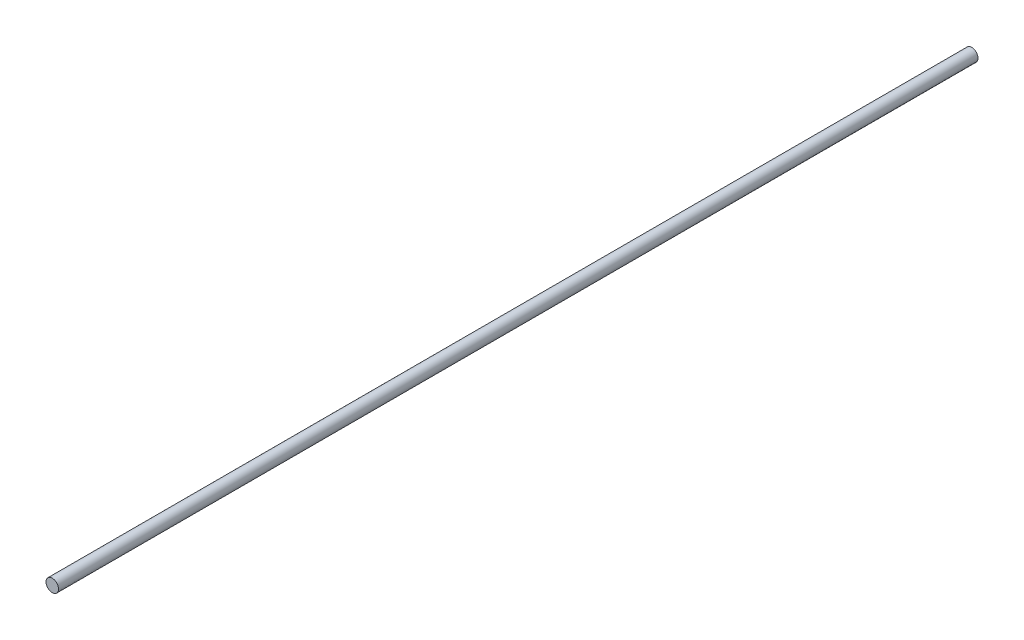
from build123d import *

# Parameters (mm, degrees)
SKETCH1_R           = 30
BOSS_EXTRUDE1_DEPTH = 4400


with BuildPart() as part:
    # Sketch1 → Boss-Extrude1 (new body)
    with BuildSketch(Plane.XY):
        Circle(SKETCH1_R)
    extrude(amount=-BOSS_EXTRUDE1_DEPTH)


solid = part.part
